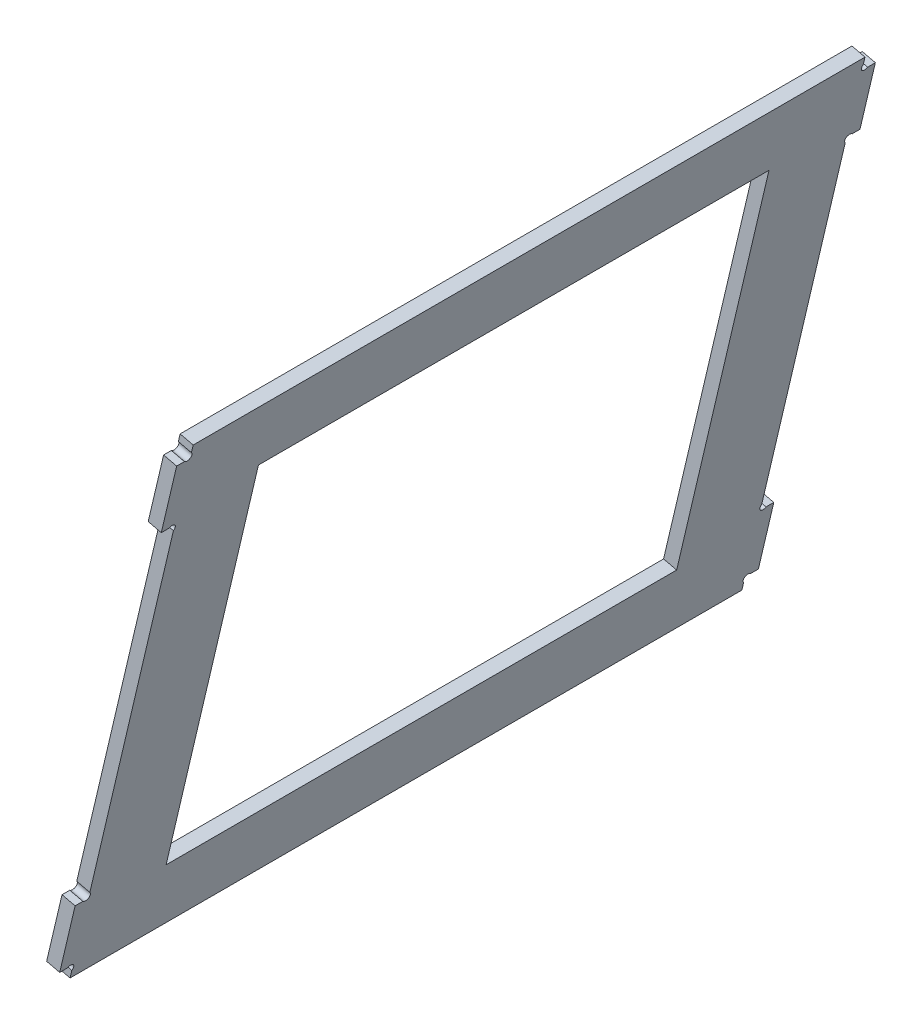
from build123d import *

# Parameters (mm, degrees)
SALIENTE_EXTRUIR1_DEPTH    = 500
CORTAR_EXTRUIR1_DEPTH      = 705.61727601
CORTAR_EXTRUIR1_DEPTH_BACK = 705.61727601
CROQUIS3_W                 = 380
CROQUIS3_H                 = 300
CROQUIS4_W                 = 10
CROQUIS4_H                 = 50
SALIENTE_EXTRUIR2_DEPTH    = 10
CROQUIS5_R                 = 3
CORTAR_EXTRUIR3_DEPTH      = 705.61727601
SIMETR_A3_COPY_1_SKETCH_W  = 10
SIMETR_A3_COPY_1_SKETCH_H  = 50
SIMETR_A3_COPY_1_DEPTH     = 10
SIMETR_A3_COPY_2_SKETCH_R  = 3
SIMETR_A3_COPY_2_DEPTH     = 705.61727601


with BuildPart() as part:
    # Croquis1 → Saliente-Extruir1 (new body)
    with BuildSketch(Plane.XY):
        Polygon((-238.219832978, 152.785786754), (-228.485745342, 150.495036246), (-136.85572503, 539.858541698), (-146.589812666, 542.149292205), align=None)
    extrude(amount=SALIENTE_EXTRUIR1_DEPTH)

    # Croquis3 → Cortar-Extruir1 (cut, two sides: drawn at the far end of the back side and taken through both)
    with BuildSketch(Plane(origin=(-259.787891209, 61.136622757, 0), x_dir=(0, 0, 1), z_dir=(-0.9734087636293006, 0.2290750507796, 0)).offset(-CORTAR_EXTRUIR1_DEPTH_BACK)):
        with Locations((250, 294.152803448)):
            Rectangle(CROQUIS3_W, CROQUIS3_H)
    extrude(amount=CORTAR_EXTRUIR1_DEPTH + CORTAR_EXTRUIR1_DEPTH_BACK, mode=Mode.SUBTRACT)

    # Croquis4 → Saliente-Extruir2 (add)
    with BuildSketch(Plane(origin=(-259.787891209, 61.136622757, 0), x_dir=(0, 0, 1), z_dir=(-0.9734087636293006, 0.2290750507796, 0))):
        with Locations((-5, 129.152803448)):
            Rectangle(CROQUIS4_W, CROQUIS4_H)
    saliente_extruir2 = extrude(amount=-SALIENTE_EXTRUIR2_DEPTH)

    # Croquis5 → Cortar-Extruir3 (cut, symmetric)
    with BuildSketch(Plane(origin=(-259.787891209, 61.136622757, 0), x_dir=(0, 0, 1), z_dir=(-0.9734087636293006, 0.2290750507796, 0))):
        with Locations((-2.121320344, 102.031483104)):
            Circle(CROQUIS5_R)
        with Locations((-2.121320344, 156.274123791)):
            Circle(CROQUIS5_R)
    cortar_extruir3 = extrude(amount=CORTAR_EXTRUIR3_DEPTH, both=True, mode=Mode.SUBTRACT)

    # Simetr_a2: Saliente-Extruir2, Cortar-Extruir3 across plane
    add(saliente_extruir2.mirror(Plane(origin=(67.383068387, 286.330916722, 0), x_dir=(0, 0, 1), z_dir=(-0.22907505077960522, -0.9734087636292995, 0))))
    add(cortar_extruir3.mirror(Plane(origin=(67.383068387, 286.330916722, 0), x_dir=(0, 0, 1), z_dir=(-0.22907505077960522, -0.9734087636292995, 0))), mode=Mode.SUBTRACT)

    # Simetr_a3: Saliente-Extruir2, Cortar-Extruir3 across plane
    add(saliente_extruir2.mirror(Plane(origin=(0, 0, 250), x_dir=(1, 0, 0), z_dir=(0, 0, -1))))
    add(cortar_extruir3.mirror(Plane(origin=(0, 0, 250), x_dir=(1, 0, 0), z_dir=(0, 0, -1))), mode=Mode.SUBTRACT)

    # Simetr_a3 copy 1 sketch → Simetr_a3 copy 1 (add)
    with BuildSketch(Plane(origin=(-125.021754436, 633.798456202, 500), x_dir=(0, 0, -1), z_dir=(-0.9734087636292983, 0.22907505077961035, 0))):
        with Locations((-5, 129.152803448)):
            Rectangle(SIMETR_A3_COPY_1_SKETCH_W, SIMETR_A3_COPY_1_SKETCH_H)
    extrude(amount=-SIMETR_A3_COPY_1_DEPTH)

    # Simetr_a3 copy 2 sketch → Simetr_a3 copy 2 (cut, symmetric)
    with BuildSketch(Plane(origin=(-125.021754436, 633.798456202, 500), x_dir=(0, 0, -1), z_dir=(-0.9734087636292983, 0.22907505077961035, 0))):
        with Locations((-2.121320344, 102.031483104)):
            Circle(SIMETR_A3_COPY_2_SKETCH_R)
        with Locations((-2.121320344, 156.274123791)):
            Circle(SIMETR_A3_COPY_2_SKETCH_R)
    extrude(amount=SIMETR_A3_COPY_2_DEPTH, both=True, mode=Mode.SUBTRACT)


solid = part.part
